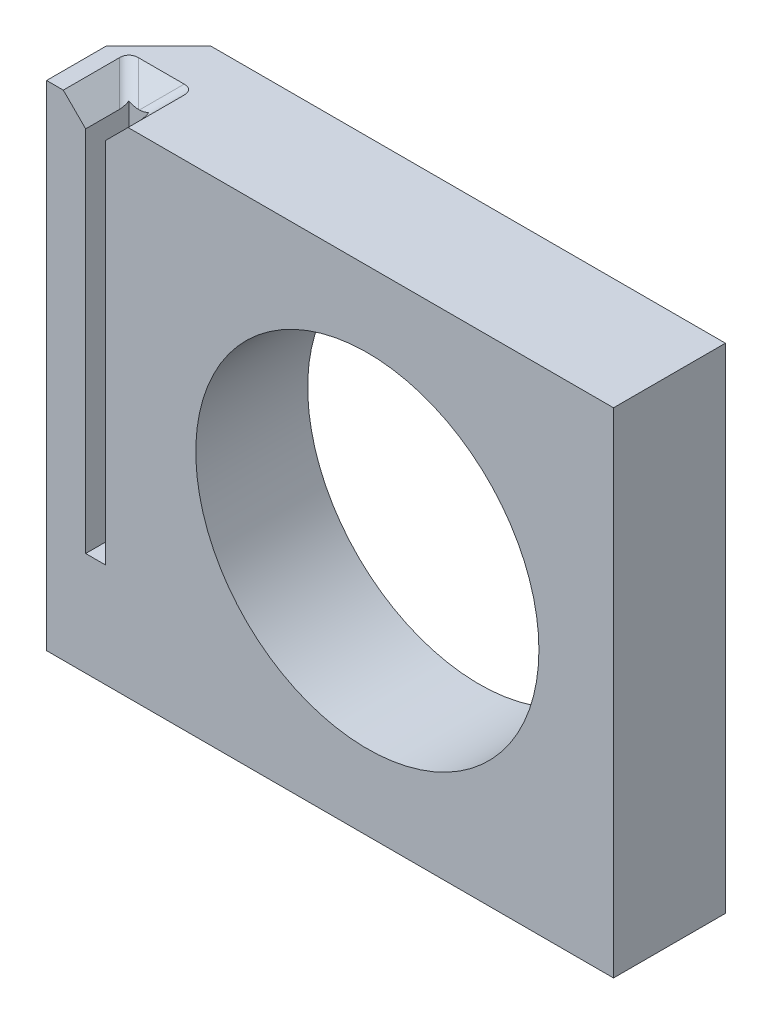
ISO-10303-21;
HEADER;
FILE_DESCRIPTION(('STEP AP214'),'2;1');
FILE_NAME('part.step','',(''),(''),'','','');
FILE_SCHEMA(('AUTOMOTIVE_DESIGN { 1 0 10303 214 1 1 1 1 }'));
ENDSEC;
DATA;
#1=APPLICATION_CONTEXT('core data for automotive mechanical design processes');
#2=APPLICATION_PROTOCOL_DEFINITION('international standard','automotive_design',2000,#1);
#3=PRODUCT_CONTEXT('',#1,'mechanical');
#4=PRODUCT('Part','Part','',(#3));
#5=PRODUCT_RELATED_PRODUCT_CATEGORY('part','',(#4));
#6=PRODUCT_DEFINITION_FORMATION('','',#4);
#7=PRODUCT_DEFINITION_CONTEXT('part definition',#1,'design');
#8=PRODUCT_DEFINITION('design','',#6,#7);
#9=PRODUCT_DEFINITION_SHAPE('','',#8);
#10=(LENGTH_UNIT() NAMED_UNIT(*) SI_UNIT(.MILLI.,.METRE.));
#11=(NAMED_UNIT(*) PLANE_ANGLE_UNIT() SI_UNIT($,.RADIAN.));
#12=(NAMED_UNIT(*) SI_UNIT($,.STERADIAN.) SOLID_ANGLE_UNIT());
#13=UNCERTAINTY_MEASURE_WITH_UNIT(LENGTH_MEASURE(1.E-05),#10,'distance_accuracy_value','');
#14=(GEOMETRIC_REPRESENTATION_CONTEXT(3) GLOBAL_UNCERTAINTY_ASSIGNED_CONTEXT((#13)) GLOBAL_UNIT_ASSIGNED_CONTEXT((#10,
#11,#12)) REPRESENTATION_CONTEXT('',''));
#15=CARTESIAN_POINT('',(0.,0.,0.));
#16=DIRECTION('',(0.,0.,1.));
#17=DIRECTION('',(1.,0.,0.));
#18=AXIS2_PLACEMENT_3D('',#15,#16,#17);
#19=CARTESIAN_POINT('',(-24.1300000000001,21.0185000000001,-9.52500000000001));
#20=DIRECTION('',(-1.,0.,0.));
#21=DIRECTION('',(0.,-1.,0.));
#22=AXIS2_PLACEMENT_3D('',#19,#20,#21);
#23=PLANE('',#22);
#24=DIRECTION('',(0.,0.,1.));
#25=VECTOR('',#24,1.);
#26=CARTESIAN_POINT('',(-24.1300000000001,21.0185000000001,-9.52500000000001));
#27=LINE('',#26,#25);
#28=CARTESIAN_POINT('',(-24.1300000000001,21.0185000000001,-5.07999999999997));
#29=VERTEX_POINT('',#28);
#30=CARTESIAN_POINT('',(-24.13,21.0185000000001,0.));
#31=VERTEX_POINT('',#30);
#32=EDGE_CURVE('E190',#29,#31,#27,.T.);
#33=ORIENTED_EDGE('',*,*,#32,.F.);
#34=DIRECTION('',(0.,-1.,0.));
#35=VECTOR('',#34,1.);
#36=CARTESIAN_POINT('',(-24.1300000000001,-21.0185,-5.07999999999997));
#37=LINE('',#36,#35);
#38=CARTESIAN_POINT('',(-24.1300000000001,-21.0185,-5.07999999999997));
#39=VERTEX_POINT('',#38);
#40=EDGE_CURVE('E193',#29,#39,#37,.T.);
#41=ORIENTED_EDGE('',*,*,#40,.T.);
#42=DIRECTION('',(0.,0.,1.));
#43=VECTOR('',#42,1.);
#44=CARTESIAN_POINT('',(-24.1300000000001,-21.0185,-9.52500000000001));
#45=LINE('',#44,#43);
#46=CARTESIAN_POINT('',(-24.13,-21.0185,0.));
#47=VERTEX_POINT('',#46);
#48=EDGE_CURVE('E189',#39,#47,#45,.T.);
#49=ORIENTED_EDGE('',*,*,#48,.T.);
#50=DIRECTION('',(0.,-1.,0.));
#51=VECTOR('',#50,1.);
#52=CARTESIAN_POINT('',(-24.13,21.0185000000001,0.));
#53=LINE('',#52,#51);
#54=EDGE_CURVE('E169',#31,#47,#53,.T.);
#55=ORIENTED_EDGE('',*,*,#54,.F.);
#56=EDGE_LOOP('',(#33,#41,#49,#55));
#57=FACE_BOUND('',#56,.T.);
#58=ADVANCED_FACE('F32',(#57),#23,.T.);
#59=CARTESIAN_POINT('',(-24.1300000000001,21.0185000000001,-9.52500000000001));
#60=DIRECTION('',(0.,1.,0.));
#61=DIRECTION('',(0.,0.,1.));
#62=AXIS2_PLACEMENT_3D('',#59,#60,#61);
#63=PLANE('',#62);
#64=DIRECTION('',(-1.,0.,0.));
#65=VECTOR('',#64,1.);
#66=CARTESIAN_POINT('',(-24.13,21.0185000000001,0.));
#67=LINE('',#66,#65);
#68=CARTESIAN_POINT('',(-22.7076,21.0185,0.));
#69=VERTEX_POINT('',#68);
#70=EDGE_CURVE('E178',#69,#31,#67,.T.);
#71=ORIENTED_EDGE('',*,*,#70,.F.);
#72=DIRECTION('',(0.,0.,-1.));
#73=VECTOR('',#72,1.);
#74=CARTESIAN_POINT('',(-22.7076,21.0185,-3.68299999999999));
#75=LINE('',#74,#73);
#76=CARTESIAN_POINT('',(-22.7076000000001,21.0185,-4.7797769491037));
#77=VERTEX_POINT('',#76);
#78=EDGE_CURVE('E217',#69,#77,#75,.T.);
#79=ORIENTED_EDGE('',*,*,#78,.T.);
#80=CARTESIAN_POINT('',(-21.0911538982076,21.0185,-3.97155389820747));
#81=DIRECTION('',(0.,1.,0.));
#82=DIRECTION('',(-0.707106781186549,0.,-0.707106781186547));
#83=AXIS2_PLACEMENT_3D('',#80,#81,#82);
#84=ELLIPSE('',#83,1.97973407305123,1.143);
#85=CARTESIAN_POINT('',(-21.8993769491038,21.0185,-5.58799999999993));
#86=VERTEX_POINT('',#85);
#87=EDGE_CURVE('E235',#77,#86,#84,.F.);
#88=ORIENTED_EDGE('',*,*,#87,.T.);
#89=DIRECTION('',(1.,0.,0.));
#90=VECTOR('',#89,1.);
#91=CARTESIAN_POINT('',(-24.1300000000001,21.0185000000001,-5.58799999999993));
#92=LINE('',#91,#90);
#93=CARTESIAN_POINT('',(-18.0040230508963,21.0185000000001,-5.58799999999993));
#94=VERTEX_POINT('',#93);
#95=EDGE_CURVE('E212',#86,#94,#92,.T.);
#96=ORIENTED_EDGE('',*,*,#95,.T.);
#97=CARTESIAN_POINT('',(-18.8122461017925,21.0185000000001,-3.97155389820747));
#98=DIRECTION('',(0.,1.,0.));
#99=DIRECTION('',(0.707106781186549,0.,-0.707106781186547));
#100=AXIS2_PLACEMENT_3D('',#97,#98,#99);
#101=ELLIPSE('',#100,1.97973407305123,1.143);
#102=CARTESIAN_POINT('',(-17.1958,21.0185,-4.7797769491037));
#103=VERTEX_POINT('',#102);
#104=EDGE_CURVE('E241',#94,#103,#101,.F.);
#105=ORIENTED_EDGE('',*,*,#104,.T.);
#106=DIRECTION('',(0.,0.,1.));
#107=VECTOR('',#106,1.);
#108=CARTESIAN_POINT('',(-17.1957999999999,21.0185,0.));
#109=LINE('',#108,#107);
#110=CARTESIAN_POINT('',(-17.1957999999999,21.0185,0.));
#111=VERTEX_POINT('',#110);
#112=EDGE_CURVE('E215',#103,#111,#109,.T.);
#113=ORIENTED_EDGE('',*,*,#112,.T.);
#114=CARTESIAN_POINT('',(24.13,21.0185000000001,4.44089209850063E-13));
#115=VERTEX_POINT('',#114);
#116=EDGE_CURVE('E179',#115,#111,#67,.T.);
#117=ORIENTED_EDGE('',*,*,#116,.F.);
#118=DIRECTION('',(0.,0.,1.));
#119=VECTOR('',#118,1.);
#120=CARTESIAN_POINT('',(24.1300000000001,21.0185000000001,-9.52499999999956));
#121=LINE('',#120,#119);
#122=CARTESIAN_POINT('',(24.1300000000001,21.0185000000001,-9.52499999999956));
#123=VERTEX_POINT('',#122);
#124=EDGE_CURVE('E194',#123,#115,#121,.T.);
#125=ORIENTED_EDGE('',*,*,#124,.F.);
#126=DIRECTION('',(-1.,0.,0.));
#127=VECTOR('',#126,1.);
#128=CARTESIAN_POINT('',(-24.1300000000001,21.0185000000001,-9.52500000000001));
#129=LINE('',#128,#127);
#130=CARTESIAN_POINT('',(-19.685,21.0185,-9.52500000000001));
#131=VERTEX_POINT('',#130);
#132=EDGE_CURVE('E186',#123,#131,#129,.T.);
#133=ORIENTED_EDGE('',*,*,#132,.T.);
#134=DIRECTION('',(-0.707106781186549,0.,0.707106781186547));
#135=VECTOR('',#134,1.);
#136=CARTESIAN_POINT('',(-21.9075,21.0185,-7.30249999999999));
#137=LINE('',#136,#135);
#138=EDGE_CURVE('E205',#131,#29,#137,.T.);
#139=ORIENTED_EDGE('',*,*,#138,.T.);
#140=ORIENTED_EDGE('',*,*,#32,.T.);
#141=EDGE_LOOP('',(#71,#79,#88,#96,#105,#113,#117,#125,#133,#139,#140));
#142=FACE_BOUND('',#141,.T.);
#143=ADVANCED_FACE('F266',(#142),#63,.T.);
#144=CARTESIAN_POINT('',(24.1300000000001,21.0185000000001,-9.52499999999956));
#145=DIRECTION('',(1.,0.,0.));
#146=DIRECTION('',(0.,1.,0.));
#147=AXIS2_PLACEMENT_3D('',#144,#145,#146);
#148=PLANE('',#147);
#149=DIRECTION('',(0.,1.,0.));
#150=VECTOR('',#149,1.);
#151=CARTESIAN_POINT('',(24.13,21.0185000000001,4.44089209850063E-13));
#152=LINE('',#151,#150);
#153=CARTESIAN_POINT('',(24.1300000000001,-21.0185,4.44089209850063E-13));
#154=VERTEX_POINT('',#153);
#155=EDGE_CURVE('E175',#154,#115,#152,.T.);
#156=ORIENTED_EDGE('',*,*,#155,.F.);
#157=DIRECTION('',(0.,0.,1.));
#158=VECTOR('',#157,1.);
#159=CARTESIAN_POINT('',(24.1300000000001,-21.0185,-9.52499999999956));
#160=LINE('',#159,#158);
#161=CARTESIAN_POINT('',(24.1300000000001,-21.0185,-9.52499999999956));
#162=VERTEX_POINT('',#161);
#163=EDGE_CURVE('E196',#162,#154,#160,.T.);
#164=ORIENTED_EDGE('',*,*,#163,.F.);
#165=DIRECTION('',(0.,1.,0.));
#166=VECTOR('',#165,1.);
#167=CARTESIAN_POINT('',(24.1300000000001,21.0185000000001,-9.52499999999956));
#168=LINE('',#167,#166);
#169=EDGE_CURVE('E183',#162,#123,#168,.T.);
#170=ORIENTED_EDGE('',*,*,#169,.T.);
#171=ORIENTED_EDGE('',*,*,#124,.T.);
#172=EDGE_LOOP('',(#156,#164,#170,#171));
#173=FACE_BOUND('',#172,.T.);
#174=ADVANCED_FACE('F284',(#173),#148,.T.);
#175=CARTESIAN_POINT('',(-24.1300000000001,-21.0185,-9.52500000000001));
#176=DIRECTION('',(0.,-1.,0.));
#177=DIRECTION('',(0.,0.,-1.));
#178=AXIS2_PLACEMENT_3D('',#175,#176,#177);
#179=PLANE('',#178);
#180=ORIENTED_EDGE('',*,*,#48,.F.);
#181=DIRECTION('',(0.707106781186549,0.,-0.707106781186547));
#182=VECTOR('',#181,1.);
#183=CARTESIAN_POINT('',(-21.9075,-21.0185,-7.30249999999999));
#184=LINE('',#183,#182);
#185=CARTESIAN_POINT('',(-19.685,-21.0185,-9.52500000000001));
#186=VERTEX_POINT('',#185);
#187=EDGE_CURVE('E201',#39,#186,#184,.T.);
#188=ORIENTED_EDGE('',*,*,#187,.T.);
#189=DIRECTION('',(1.,0.,0.));
#190=VECTOR('',#189,1.);
#191=CARTESIAN_POINT('',(-24.1300000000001,-21.0185,-9.52500000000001));
#192=LINE('',#191,#190);
#193=EDGE_CURVE('E181',#186,#162,#192,.T.);
#194=ORIENTED_EDGE('',*,*,#193,.T.);
#195=ORIENTED_EDGE('',*,*,#163,.T.);
#196=DIRECTION('',(1.,0.,0.));
#197=VECTOR('',#196,1.);
#198=CARTESIAN_POINT('',(-24.13,-21.0185,0.));
#199=LINE('',#198,#197);
#200=EDGE_CURVE('E172',#47,#154,#199,.T.);
#201=ORIENTED_EDGE('',*,*,#200,.F.);
#202=EDGE_LOOP('',(#180,#188,#194,#195,#201));
#203=FACE_BOUND('',#202,.T.);
#204=ADVANCED_FACE('F294',(#203),#179,.T.);
#205=CARTESIAN_POINT('',(-24.1300000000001,-21.0185,-9.52500000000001));
#206=DIRECTION('',(0.,0.,1.));
#207=DIRECTION('',(1.,0.,0.));
#208=AXIS2_PLACEMENT_3D('',#205,#206,#207);
#209=PLANE('',#208);
#210=CARTESIAN_POINT('',(3.17500000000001,0.,-9.52500000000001));
#211=DIRECTION('',(0.,0.,1.));
#212=DIRECTION('',(1.,0.,0.));
#213=AXIS2_PLACEMENT_3D('',#210,#211,#212);
#214=CIRCLE('',#213,14.605);
#215=CARTESIAN_POINT('',(17.78,0.,-9.525));
#216=VERTEX_POINT('',#215);
#217=EDGE_CURVE('E166',#216,#216,#214,.T.);
#218=ORIENTED_EDGE('',*,*,#217,.T.);
#219=EDGE_LOOP('',(#218));
#220=FACE_BOUND('',#219,.T.);
#221=ORIENTED_EDGE('',*,*,#193,.F.);
#222=DIRECTION('',(0.,1.,0.));
#223=VECTOR('',#222,1.);
#224=CARTESIAN_POINT('',(-19.685,21.0185,-9.52500000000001));
#225=LINE('',#224,#223);
#226=EDGE_CURVE('E203',#186,#131,#225,.T.);
#227=ORIENTED_EDGE('',*,*,#226,.T.);
#228=ORIENTED_EDGE('',*,*,#132,.F.);
#229=ORIENTED_EDGE('',*,*,#169,.F.);
#230=EDGE_LOOP('',(#221,#227,#228,#229));
#231=FACE_BOUND('',#230,.T.);
#232=ADVANCED_FACE('F299',(#220,#231),#209,.F.);
#233=CARTESIAN_POINT('',(-24.13,-21.0185,0.));
#234=DIRECTION('',(0.,0.,1.));
#235=DIRECTION('',(1.,0.,0.));
#236=AXIS2_PLACEMENT_3D('',#233,#234,#235);
#237=PLANE('',#236);
#238=DIRECTION('',(0.,-1.,0.));
#239=VECTOR('',#238,1.);
#240=CARTESIAN_POINT('',(-20.8026,21.0185000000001,0.));
#241=LINE('',#240,#239);
#242=CARTESIAN_POINT('',(-20.8026,19.1135000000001,0.));
#243=VERTEX_POINT('',#242);
#244=CARTESIAN_POINT('',(-20.8026,-12.192,0.));
#245=VERTEX_POINT('',#244);
#246=EDGE_CURVE('E149',#243,#245,#241,.T.);
#247=ORIENTED_EDGE('',*,*,#246,.F.);
#248=DIRECTION('',(-0.70710678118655,0.707106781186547,0.));
#249=VECTOR('',#248,1.);
#250=CARTESIAN_POINT('',(-2.40029999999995,0.711200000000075,0.));
#251=LINE('',#250,#249);
#252=EDGE_CURVE('E210',#243,#69,#251,.T.);
#253=ORIENTED_EDGE('',*,*,#252,.T.);
#254=ORIENTED_EDGE('',*,*,#70,.T.);
#255=ORIENTED_EDGE('',*,*,#54,.T.);
#256=ORIENTED_EDGE('',*,*,#200,.T.);
#257=ORIENTED_EDGE('',*,*,#155,.T.);
#258=ORIENTED_EDGE('',*,*,#116,.T.);
#259=DIRECTION('',(-0.70710678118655,-0.707106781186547,0.));
#260=VECTOR('',#259,1.);
#261=CARTESIAN_POINT('',(-41.6814000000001,-3.46709999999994,4.44089209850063E-13));
#262=LINE('',#261,#260);
#263=CARTESIAN_POINT('',(-19.1008000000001,19.1135,0.));
#264=VERTEX_POINT('',#263);
#265=EDGE_CURVE('E155',#111,#264,#262,.T.);
#266=ORIENTED_EDGE('',*,*,#265,.T.);
#267=DIRECTION('',(0.,1.,0.));
#268=VECTOR('',#267,1.);
#269=CARTESIAN_POINT('',(-19.1008,21.0185000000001,0.));
#270=LINE('',#269,#268);
#271=CARTESIAN_POINT('',(-19.1008000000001,-12.192,0.));
#272=VERTEX_POINT('',#271);
#273=EDGE_CURVE('E136',#272,#264,#270,.T.);
#274=ORIENTED_EDGE('',*,*,#273,.F.);
#275=DIRECTION('',(1.,0.,0.));
#276=VECTOR('',#275,1.);
#277=CARTESIAN_POINT('',(-20.8026,-12.192,0.));
#278=LINE('',#277,#276);
#279=EDGE_CURVE('E145',#245,#272,#278,.T.);
#280=ORIENTED_EDGE('',*,*,#279,.F.);
#281=EDGE_LOOP('',(#247,#253,#254,#255,#256,#257,#258,#266,#274,#280));
#282=FACE_BOUND('',#281,.T.);
#283=CARTESIAN_POINT('',(3.17500000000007,0.,0.));
#284=DIRECTION('',(0.,0.,1.));
#285=DIRECTION('',(1.,0.,0.));
#286=AXIS2_PLACEMENT_3D('',#283,#284,#285);
#287=CIRCLE('',#286,14.605);
#288=CARTESIAN_POINT('',(17.78,0.,0.));
#289=VERTEX_POINT('',#288);
#290=EDGE_CURVE('E140',#289,#289,#287,.T.);
#291=ORIENTED_EDGE('',*,*,#290,.F.);
#292=EDGE_LOOP('',(#291));
#293=FACE_BOUND('',#292,.T.);
#294=ADVANCED_FACE('F151',(#282,#293),#237,.T.);
#295=CARTESIAN_POINT('',(3.17500000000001,0.,-9.52500000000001));
#296=DIRECTION('',(0.,0.,1.));
#297=DIRECTION('',(1.,0.,0.));
#298=AXIS2_PLACEMENT_3D('',#295,#296,#297);
#299=CYLINDRICAL_SURFACE('',#298,14.605);
#300=CARTESIAN_POINT('',(17.78,0.,-9.525));
#301=CARTESIAN_POINT('',(17.78,0.,-9.42578125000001));
#302=CARTESIAN_POINT('',(17.78,0.,-9.3265625));
#303=CARTESIAN_POINT('',(17.78,0.,-9.12812500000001));
#304=CARTESIAN_POINT('',(17.78,0.,-9.02890625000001));
#305=CARTESIAN_POINT('',(17.78,0.,-8.83046875));
#306=CARTESIAN_POINT('',(17.78,0.,-8.73125));
#307=CARTESIAN_POINT('',(17.78,0.,-8.5328125));
#308=CARTESIAN_POINT('',(17.78,0.,-8.43359375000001));
#309=CARTESIAN_POINT('',(17.78,0.,-8.23515625));
#310=CARTESIAN_POINT('',(17.78,0.,-8.1359375));
#311=CARTESIAN_POINT('',(17.78,0.,-7.9375));
#312=CARTESIAN_POINT('',(17.78,0.,-7.83828125));
#313=CARTESIAN_POINT('',(17.78,0.,-7.63984375));
#314=CARTESIAN_POINT('',(17.78,0.,-7.540625));
#315=CARTESIAN_POINT('',(17.78,0.,-7.3421875));
#316=CARTESIAN_POINT('',(17.78,0.,-7.24296875));
#317=CARTESIAN_POINT('',(17.78,0.,-7.04453125));
#318=CARTESIAN_POINT('',(17.78,0.,-6.9453125));
#319=CARTESIAN_POINT('',(17.78,0.,-6.746875));
#320=CARTESIAN_POINT('',(17.78,0.,-6.64765625));
#321=CARTESIAN_POINT('',(17.78,0.,-6.44921875));
#322=CARTESIAN_POINT('',(17.78,0.,-6.35));
#323=CARTESIAN_POINT('',(17.78,0.,-6.1515625));
#324=CARTESIAN_POINT('',(17.78,0.,-6.05234375));
#325=CARTESIAN_POINT('',(17.78,0.,-5.85390625));
#326=CARTESIAN_POINT('',(17.78,0.,-5.7546875));
#327=CARTESIAN_POINT('',(17.78,0.,-5.55625));
#328=CARTESIAN_POINT('',(17.78,0.,-5.45703125));
#329=CARTESIAN_POINT('',(17.78,0.,-5.25859375));
#330=CARTESIAN_POINT('',(17.78,0.,-5.159375));
#331=CARTESIAN_POINT('',(17.78,0.,-4.9609375));
#332=CARTESIAN_POINT('',(17.78,0.,-4.86171875));
#333=CARTESIAN_POINT('',(17.78,0.,-4.66328125));
#334=CARTESIAN_POINT('',(17.78,0.,-4.5640625));
#335=CARTESIAN_POINT('',(17.78,0.,-4.365625));
#336=CARTESIAN_POINT('',(17.78,0.,-4.26640625));
#337=CARTESIAN_POINT('',(17.78,0.,-4.06796875));
#338=CARTESIAN_POINT('',(17.78,0.,-3.96875));
#339=CARTESIAN_POINT('',(17.78,0.,-3.7703125));
#340=CARTESIAN_POINT('',(17.78,0.,-3.67109375));
#341=CARTESIAN_POINT('',(17.78,0.,-3.47265625));
#342=CARTESIAN_POINT('',(17.78,0.,-3.3734375));
#343=CARTESIAN_POINT('',(17.78,0.,-3.175));
#344=CARTESIAN_POINT('',(17.78,0.,-3.07578125));
#345=CARTESIAN_POINT('',(17.78,0.,-2.87734375));
#346=CARTESIAN_POINT('',(17.78,0.,-2.778125));
#347=CARTESIAN_POINT('',(17.78,0.,-2.5796875));
#348=CARTESIAN_POINT('',(17.78,0.,-2.48046875));
#349=CARTESIAN_POINT('',(17.78,0.,-2.28203125));
#350=CARTESIAN_POINT('',(17.78,0.,-2.1828125));
#351=CARTESIAN_POINT('',(17.78,0.,-1.984375));
#352=CARTESIAN_POINT('',(17.78,0.,-1.88515625));
#353=CARTESIAN_POINT('',(17.78,0.,-1.68671875));
#354=CARTESIAN_POINT('',(17.78,0.,-1.5875));
#355=CARTESIAN_POINT('',(17.78,0.,-1.3890625));
#356=CARTESIAN_POINT('',(17.78,0.,-1.28984375));
#357=CARTESIAN_POINT('',(17.78,0.,-1.09140625));
#358=CARTESIAN_POINT('',(17.78,0.,-0.992187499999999));
#359=CARTESIAN_POINT('',(17.78,0.,-0.793749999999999));
#360=CARTESIAN_POINT('',(17.78,0.,-0.694531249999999));
#361=CARTESIAN_POINT('',(17.78,0.,-0.496093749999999));
#362=CARTESIAN_POINT('',(17.78,0.,-0.396874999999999));
#363=CARTESIAN_POINT('',(17.78,0.,-0.198437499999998));
#364=CARTESIAN_POINT('',(17.78,0.,-0.0992187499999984));
#365=CARTESIAN_POINT('',(17.78,0.,0.));
#366=B_SPLINE_CURVE_WITH_KNOTS('',3,(#300,#301,#302,#303,#304,#305,#306,#307,#308,#309,#310,
#311,#312,#313,#314,#315,#316,#317,#318,#319,#320,#321,#322,#323,#324,#325,#326,#327,#328,#329,
#330,#331,#332,#333,#334,#335,#336,#337,#338,#339,#340,#341,#342,#343,#344,#345,#346,#347,#348,
#349,#350,#351,#352,#353,#354,#355,#356,#357,#358,#359,#360,#361,#362,#363,#364,#365),
.UNSPECIFIED.,.F.,.F.,(4,2,2,2,2,2,2,2,2,2,2,2,2,2,2,2,2,2,2,2,2,2,2,2,2,2,2,2,2,2,2,2,4),(0.,
0.297656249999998,0.595312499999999,0.892968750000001,1.190625,1.48828125,1.7859375,2.08359375,
2.38125,2.67890625,2.9765625,3.27421875,3.571875,3.86953125,4.1671875,4.46484375,4.7625,
5.06015625,5.3578125,5.65546875,5.953125,6.25078125,6.5484375,6.84609375,7.14375,7.44140625,
7.7390625,8.03671875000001,8.334375,8.63203125,8.92968750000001,9.22734375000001,
9.52500000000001),.UNSPECIFIED.);
#367=EDGE_CURVE('BSEAM321',#216,#289,#366,.T.);
#368=ORIENTED_EDGE('',*,*,#217,.F.);
#369=ORIENTED_EDGE('',*,*,#290,.T.);
#370=ORIENTED_EDGE('',*,*,#367,.T.);
#371=ORIENTED_EDGE('',*,*,#367,.F.);
#372=EDGE_LOOP('',(#368,#370,#369,#371));
#373=FACE_BOUND('',#372,.T.);
#374=ADVANCED_FACE('F321',(#373),#299,.F.);
#375=CARTESIAN_POINT('',(-20.8026,21.0185000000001,-3.68299999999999));
#376=DIRECTION('',(-1.,0.,0.));
#377=DIRECTION('',(0.,-1.,0.));
#378=AXIS2_PLACEMENT_3D('',#375,#376,#377);
#379=PLANE('',#378);
#380=DIRECTION('',(0.,-1.,0.));
#381=VECTOR('',#380,1.);
#382=CARTESIAN_POINT('',(-20.8026,21.0185000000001,-3.68299999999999));
#383=LINE('',#382,#381);
#384=CARTESIAN_POINT('',(-20.8026,19.3300627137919,-3.68299999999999));
#385=VERTEX_POINT('',#384);
#386=CARTESIAN_POINT('',(-20.8026,-12.192,-3.68299999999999));
#387=VERTEX_POINT('',#386);
#388=EDGE_CURVE('E53',#385,#387,#383,.T.);
#389=ORIENTED_EDGE('',*,*,#388,.F.);
#390=CARTESIAN_POINT('',(-20.8026,20.7299461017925,-3.68299999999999));
#391=DIRECTION('',(-1.,0.,0.));
#392=DIRECTION('',(0.,0.707106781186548,-0.707106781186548));
#393=AXIS2_PLACEMENT_3D('',#390,#391,#392);
#394=ELLIPSE('',#393,1.97973407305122,1.143);
#395=CARTESIAN_POINT('',(-20.8026,19.1135000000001,-2.87477694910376));
#396=VERTEX_POINT('',#395);
#397=EDGE_CURVE('E239',#385,#396,#394,.T.);
#398=ORIENTED_EDGE('',*,*,#397,.T.);
#399=DIRECTION('',(0.,0.,1.));
#400=VECTOR('',#399,1.);
#401=CARTESIAN_POINT('',(-20.8026,19.1135000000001,0.));
#402=LINE('',#401,#400);
#403=EDGE_CURVE('E207',#396,#243,#402,.T.);
#404=ORIENTED_EDGE('',*,*,#403,.T.);
#405=ORIENTED_EDGE('',*,*,#246,.T.);
#406=DIRECTION('',(0.,0.,1.));
#407=VECTOR('',#406,1.);
#408=CARTESIAN_POINT('',(-20.8026,-12.192,-3.68299999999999));
#409=LINE('',#408,#407);
#410=EDGE_CURVE('E141',#387,#245,#409,.T.);
#411=ORIENTED_EDGE('',*,*,#410,.F.);
#412=EDGE_LOOP('',(#389,#398,#404,#405,#411));
#413=FACE_BOUND('',#412,.T.);
#414=ADVANCED_FACE('F259',(#413),#379,.F.);
#415=CARTESIAN_POINT('',(-19.1008,21.0185000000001,-3.68299999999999));
#416=DIRECTION('',(1.,0.,0.));
#417=DIRECTION('',(0.,1.,0.));
#418=AXIS2_PLACEMENT_3D('',#415,#416,#417);
#419=PLANE('',#418);
#420=ORIENTED_EDGE('',*,*,#273,.T.);
#421=DIRECTION('',(0.,0.,-1.));
#422=VECTOR('',#421,1.);
#423=CARTESIAN_POINT('',(-19.1008,19.1135,-3.68299999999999));
#424=LINE('',#423,#422);
#425=CARTESIAN_POINT('',(-19.1008,19.1135,-2.87477694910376));
#426=VERTEX_POINT('',#425);
#427=EDGE_CURVE('E220',#264,#426,#424,.T.);
#428=ORIENTED_EDGE('',*,*,#427,.T.);
#429=CARTESIAN_POINT('',(-19.1008,20.7299461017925,-3.68299999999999));
#430=DIRECTION('',(1.,0.,0.));
#431=DIRECTION('',(0.,0.707106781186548,-0.707106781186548));
#432=AXIS2_PLACEMENT_3D('',#429,#430,#431);
#433=ELLIPSE('',#432,1.97973407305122,1.143);
#434=CARTESIAN_POINT('',(-19.1008000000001,19.3300627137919,-3.68299999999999));
#435=VERTEX_POINT('',#434);
#436=EDGE_CURVE('E39',#426,#435,#433,.T.);
#437=ORIENTED_EDGE('',*,*,#436,.T.);
#438=DIRECTION('',(0.,1.,0.));
#439=VECTOR('',#438,1.);
#440=CARTESIAN_POINT('',(-19.1008,21.0185000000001,-3.68299999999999));
#441=LINE('',#440,#439);
#442=CARTESIAN_POINT('',(-19.1008,-12.192,-3.68299999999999));
#443=VERTEX_POINT('',#442);
#444=EDGE_CURVE('E45',#443,#435,#441,.T.);
#445=ORIENTED_EDGE('',*,*,#444,.F.);
#446=DIRECTION('',(0.,0.,1.));
#447=VECTOR('',#446,1.);
#448=CARTESIAN_POINT('',(-19.1008,-12.192,-3.68299999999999));
#449=LINE('',#448,#447);
#450=EDGE_CURVE('E131',#443,#272,#449,.T.);
#451=ORIENTED_EDGE('',*,*,#450,.T.);
#452=EDGE_LOOP('',(#420,#428,#437,#445,#451));
#453=FACE_BOUND('',#452,.T.);
#454=ADVANCED_FACE('F133',(#453),#419,.F.);
#455=CARTESIAN_POINT('',(-20.8026,-12.192,-3.68299999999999));
#456=DIRECTION('',(0.,-1.,0.));
#457=DIRECTION('',(1.,0.,0.));
#458=AXIS2_PLACEMENT_3D('',#455,#456,#457);
#459=PLANE('',#458);
#460=ORIENTED_EDGE('',*,*,#279,.T.);
#461=ORIENTED_EDGE('',*,*,#450,.F.);
#462=DIRECTION('',(1.,0.,0.));
#463=VECTOR('',#462,1.);
#464=CARTESIAN_POINT('',(-20.8026,-12.192,-3.68299999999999));
#465=LINE('',#464,#463);
#466=EDGE_CURVE('E157',#387,#443,#465,.T.);
#467=ORIENTED_EDGE('',*,*,#466,.F.);
#468=ORIENTED_EDGE('',*,*,#410,.T.);
#469=EDGE_LOOP('',(#460,#461,#467,#468));
#470=FACE_BOUND('',#469,.T.);
#471=ADVANCED_FACE('F146',(#470),#459,.F.);
#472=CARTESIAN_POINT('',(-20.8026,-12.192,-3.68299999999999));
#473=DIRECTION('',(0.,0.,1.));
#474=DIRECTION('',(1.,0.,0.));
#475=AXIS2_PLACEMENT_3D('',#472,#473,#474);
#476=PLANE('',#475);
#477=ORIENTED_EDGE('',*,*,#444,.T.);
#478=CARTESIAN_POINT('',(-19.1008,20.7299461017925,-3.68299999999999));
#479=DIRECTION('',(0.,0.,1.));
#480=DIRECTION('',(0.70710678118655,0.707106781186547,0.));
#481=AXIS2_PLACEMENT_3D('',#478,#479,#480);
#482=ELLIPSE('',#481,1.97973407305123,1.143);
#483=CARTESIAN_POINT('',(-19.9090230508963,19.1135,-3.68299999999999));
#484=VERTEX_POINT('',#483);
#485=EDGE_CURVE('E11',#435,#484,#482,.F.);
#486=ORIENTED_EDGE('',*,*,#485,.T.);
#487=DIRECTION('',(-1.,0.,0.));
#488=VECTOR('',#487,1.);
#489=CARTESIAN_POINT('',(-20.8026,19.1135000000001,-3.68299999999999));
#490=LINE('',#489,#488);
#491=CARTESIAN_POINT('',(-19.9943769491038,19.1135,-3.68299999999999));
#492=VERTEX_POINT('',#491);
#493=EDGE_CURVE('E222',#484,#492,#490,.T.);
#494=ORIENTED_EDGE('',*,*,#493,.T.);
#495=CARTESIAN_POINT('',(-20.8026,20.7299461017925,-3.68299999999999));
#496=DIRECTION('',(0.,0.,1.));
#497=DIRECTION('',(-0.70710678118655,0.707106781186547,0.));
#498=AXIS2_PLACEMENT_3D('',#495,#496,#497);
#499=ELLIPSE('',#498,1.97973407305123,1.143);
#500=EDGE_CURVE('E237',#492,#385,#499,.F.);
#501=ORIENTED_EDGE('',*,*,#500,.T.);
#502=ORIENTED_EDGE('',*,*,#388,.T.);
#503=ORIENTED_EDGE('',*,*,#466,.T.);
#504=EDGE_LOOP('',(#477,#486,#494,#501,#502,#503));
#505=FACE_BOUND('',#504,.T.);
#506=ADVANCED_FACE('F249',(#505),#476,.T.);
#507=CARTESIAN_POINT('',(-24.1300000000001,21.0185000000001,-5.07999999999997));
#508=DIRECTION('',(-0.707106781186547,0.,-0.707106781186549));
#509=DIRECTION('',(-0.707106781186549,0.,0.707106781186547));
#510=AXIS2_PLACEMENT_3D('',#507,#508,#509);
#511=PLANE('',#510);
#512=ORIENTED_EDGE('',*,*,#138,.F.);
#513=ORIENTED_EDGE('',*,*,#226,.F.);
#514=ORIENTED_EDGE('',*,*,#187,.F.);
#515=ORIENTED_EDGE('',*,*,#40,.F.);
#516=EDGE_LOOP('',(#512,#513,#514,#515));
#517=FACE_BOUND('',#516,.T.);
#518=ADVANCED_FACE('F290',(#517),#511,.T.);
#519=CARTESIAN_POINT('',(-17.1958,21.0185,-9.52500000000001));
#520=DIRECTION('',(-0.707106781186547,0.70710678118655,0.));
#521=DIRECTION('',(-0.70710678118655,-0.707106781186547,0.));
#522=AXIS2_PLACEMENT_3D('',#519,#520,#521);
#523=PLANE('',#522);
#524=ORIENTED_EDGE('',*,*,#112,.F.);
#525=DIRECTION('',(-0.577350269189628,-0.577350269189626,0.577350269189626));
#526=VECTOR('',#525,1.);
#527=CARTESIAN_POINT('',(-18.8313923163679,19.3829076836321,-3.1441846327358));
#528=LINE('',#527,#526);
#529=EDGE_CURVE('E233',#103,#426,#528,.T.);
#530=ORIENTED_EDGE('',*,*,#529,.T.);
#531=ORIENTED_EDGE('',*,*,#427,.F.);
#532=ORIENTED_EDGE('',*,*,#265,.F.);
#533=EDGE_LOOP('',(#524,#530,#531,#532));
#534=FACE_BOUND('',#533,.T.);
#535=ADVANCED_FACE('F277',(#534),#523,.T.);
#536=CARTESIAN_POINT('',(-20.8026,19.1135000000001,-3.68299999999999));
#537=DIRECTION('',(0.,-0.707106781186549,-0.707106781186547));
#538=DIRECTION('',(0.,0.707106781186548,-0.707106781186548));
#539=AXIS2_PLACEMENT_3D('',#536,#537,#538);
#540=PLANE('',#539);
#541=ORIENTED_EDGE('',*,*,#95,.F.);
#542=DIRECTION('',(-0.577350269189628,0.577350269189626,-0.577350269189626));
#543=VECTOR('',#542,1.);
#544=CARTESIAN_POINT('',(-20.2637846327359,19.3829076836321,-3.95240768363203));
#545=LINE('',#544,#543);
#546=EDGE_CURVE('E231',#86,#492,#545,.F.);
#547=ORIENTED_EDGE('',*,*,#546,.T.);
#548=ORIENTED_EDGE('',*,*,#493,.F.);
#549=DIRECTION('',(0.577350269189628,0.577350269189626,-0.577350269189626));
#550=VECTOR('',#549,1.);
#551=CARTESIAN_POINT('',(-17.7346153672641,21.2879076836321,-5.85740768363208));
#552=LINE('',#551,#550);
#553=EDGE_CURVE('E228',#484,#94,#552,.T.);
#554=ORIENTED_EDGE('',*,*,#553,.T.);
#555=EDGE_LOOP('',(#541,#547,#548,#554));
#556=FACE_BOUND('',#555,.T.);
#557=ADVANCED_FACE('F253',(#556),#540,.F.);
#558=CARTESIAN_POINT('',(-20.8026,19.1135000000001,-3.68299999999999));
#559=DIRECTION('',(0.707106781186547,0.70710678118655,0.));
#560=DIRECTION('',(-0.70710678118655,0.707106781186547,0.));
#561=AXIS2_PLACEMENT_3D('',#558,#559,#560);
#562=PLANE('',#561);
#563=ORIENTED_EDGE('',*,*,#403,.F.);
#564=DIRECTION('',(0.577350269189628,-0.577350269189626,0.577350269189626));
#565=VECTOR('',#564,1.);
#566=CARTESIAN_POINT('',(-22.9770076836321,21.2879076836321,-5.04918463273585));
#567=LINE('',#566,#565);
#568=EDGE_CURVE('E225',#396,#77,#567,.F.);
#569=ORIENTED_EDGE('',*,*,#568,.T.);
#570=ORIENTED_EDGE('',*,*,#78,.F.);
#571=ORIENTED_EDGE('',*,*,#252,.F.);
#572=EDGE_LOOP('',(#563,#569,#570,#571));
#573=FACE_BOUND('',#572,.T.);
#574=ADVANCED_FACE('F269',(#573),#562,.T.);
#575=CARTESIAN_POINT('',(-20.2637846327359,20.1911307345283,-3.1441846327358));
#576=DIRECTION('',(-0.577350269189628,0.577350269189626,-0.577350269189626));
#577=DIRECTION('',(-0.707106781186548,0.,0.707106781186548));
#578=AXIS2_PLACEMENT_3D('',#575,#576,#577);
#579=CYLINDRICAL_SURFACE('',#578,1.143);
#580=ORIENTED_EDGE('',*,*,#500,.F.);
#581=ORIENTED_EDGE('',*,*,#546,.F.);
#582=ORIENTED_EDGE('',*,*,#87,.F.);
#583=ORIENTED_EDGE('',*,*,#568,.F.);
#584=ORIENTED_EDGE('',*,*,#397,.F.);
#585=EDGE_LOOP('',(#580,#581,#582,#583,#584));
#586=FACE_BOUND('',#585,.T.);
#587=ADVANCED_FACE('F256',(#586),#579,.F.);
#588=CARTESIAN_POINT('',(-20.2068820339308,19.6238640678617,-2.57691796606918));
#589=DIRECTION('',(0.577350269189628,0.577350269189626,-0.577350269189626));
#590=DIRECTION('',(-0.707106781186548,0.,-0.707106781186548));
#591=AXIS2_PLACEMENT_3D('',#588,#589,#590);
#592=CYLINDRICAL_SURFACE('',#591,1.143);
#593=ORIENTED_EDGE('',*,*,#436,.F.);
#594=ORIENTED_EDGE('',*,*,#529,.F.);
#595=ORIENTED_EDGE('',*,*,#104,.F.);
#596=ORIENTED_EDGE('',*,*,#553,.F.);
#597=ORIENTED_EDGE('',*,*,#485,.F.);
#598=EDGE_LOOP('',(#593,#594,#595,#596,#597));
#599=FACE_BOUND('',#598,.T.);
#600=ADVANCED_FACE('F247',(#599),#592,.F.);
#601=CLOSED_SHELL('',(#58,#143,#174,#204,#232,#294,#374,#414,#454,#471,#506,#518,#535,#557,#574,
#587,#600));
#602=MANIFOLD_SOLID_BREP('B2',#601);
#603=ADVANCED_BREP_SHAPE_REPRESENTATION('',(#18,#602),#14);
#604=SHAPE_DEFINITION_REPRESENTATION(#9,#603);
ENDSEC;
END-ISO-10303-21;
